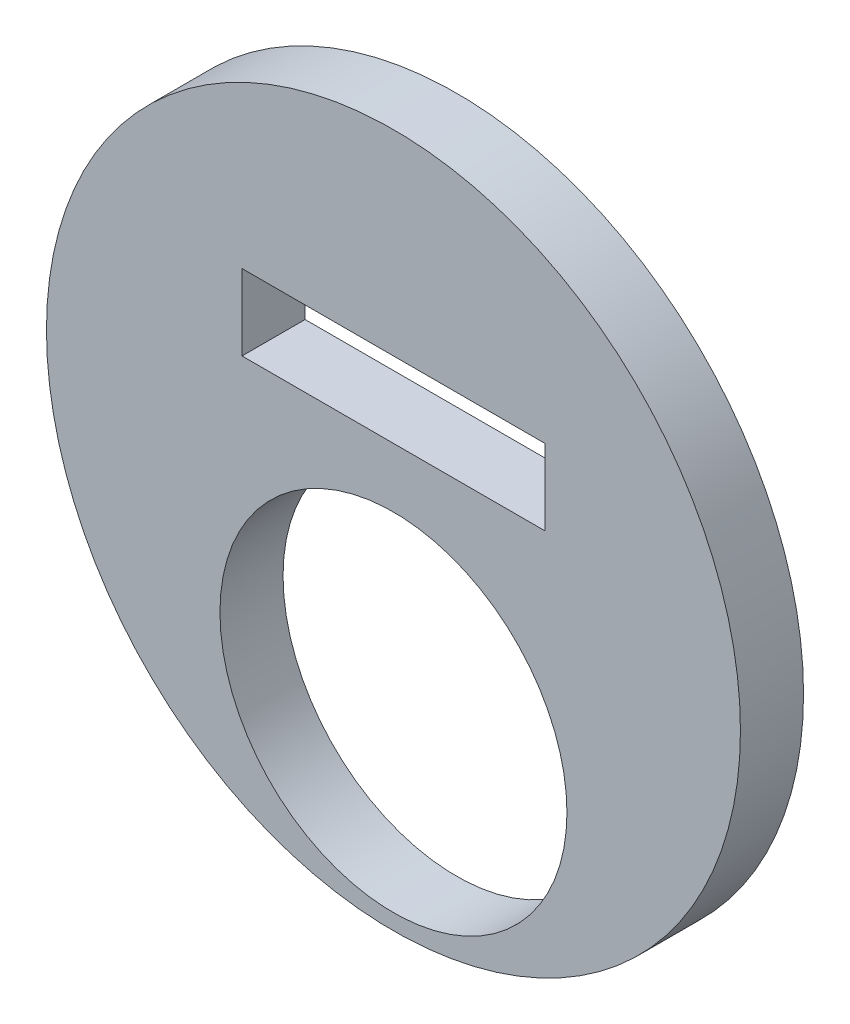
ISO-10303-21;
HEADER;
FILE_DESCRIPTION(('STEP AP214'),'2;1');
FILE_NAME('part.step','',(''),(''),'','','');
FILE_SCHEMA(('AUTOMOTIVE_DESIGN { 1 0 10303 214 1 1 1 1 }'));
ENDSEC;
DATA;
#1=APPLICATION_CONTEXT('core data for automotive mechanical design processes');
#2=APPLICATION_PROTOCOL_DEFINITION('international standard','automotive_design',2000,#1);
#3=PRODUCT_CONTEXT('',#1,'mechanical');
#4=PRODUCT('Part','Part','',(#3));
#5=PRODUCT_RELATED_PRODUCT_CATEGORY('part','',(#4));
#6=PRODUCT_DEFINITION_FORMATION('','',#4);
#7=PRODUCT_DEFINITION_CONTEXT('part definition',#1,'design');
#8=PRODUCT_DEFINITION('design','',#6,#7);
#9=PRODUCT_DEFINITION_SHAPE('','',#8);
#10=(LENGTH_UNIT() NAMED_UNIT(*) SI_UNIT(.MILLI.,.METRE.));
#11=(NAMED_UNIT(*) PLANE_ANGLE_UNIT() SI_UNIT($,.RADIAN.));
#12=(NAMED_UNIT(*) SI_UNIT($,.STERADIAN.) SOLID_ANGLE_UNIT());
#13=UNCERTAINTY_MEASURE_WITH_UNIT(LENGTH_MEASURE(1.E-05),#10,'distance_accuracy_value','');
#14=(GEOMETRIC_REPRESENTATION_CONTEXT(3) GLOBAL_UNCERTAINTY_ASSIGNED_CONTEXT((#13)) GLOBAL_UNIT_ASSIGNED_CONTEXT((#10,
#11,#12)) REPRESENTATION_CONTEXT('',''));
#15=CARTESIAN_POINT('',(0.,0.,0.));
#16=DIRECTION('',(0.,0.,1.));
#17=DIRECTION('',(1.,0.,0.));
#18=AXIS2_PLACEMENT_3D('',#15,#16,#17);
#19=CARTESIAN_POINT('',(0.,0.,3.175));
#20=DIRECTION('',(0.,0.,1.));
#21=DIRECTION('',(1.,0.,0.));
#22=AXIS2_PLACEMENT_3D('',#19,#20,#21);
#23=PLANE('',#22);
#24=CARTESIAN_POINT('',(0.,-7.9375,3.175));
#25=DIRECTION('',(0.,0.,1.));
#26=DIRECTION('',(1.,0.,0.));
#27=AXIS2_PLACEMENT_3D('',#24,#25,#26);
#28=CIRCLE('',#27,8.7312500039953);
#29=CARTESIAN_POINT('',(8.7312500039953,-7.9375,3.175));
#30=VERTEX_POINT('',#29);
#31=EDGE_CURVE('E95',#30,#30,#28,.T.);
#32=ORIENTED_EDGE('',*,*,#31,.F.);
#33=EDGE_LOOP('',(#32));
#34=FACE_BOUND('',#33,.T.);
#35=CARTESIAN_POINT('',(0.,0.,3.175));
#36=DIRECTION('',(0.,0.,1.));
#37=DIRECTION('',(1.,0.,0.));
#38=AXIS2_PLACEMENT_3D('',#35,#36,#37);
#39=CIRCLE('',#38,17.4625);
#40=CARTESIAN_POINT('',(17.4625,0.,3.175));
#41=VERTEX_POINT('',#40);
#42=EDGE_CURVE('E11',#41,#41,#39,.T.);
#43=ORIENTED_EDGE('',*,*,#42,.T.);
#44=EDGE_LOOP('',(#43));
#45=FACE_BOUND('',#44,.T.);
#46=DIRECTION('',(1.,0.,0.));
#47=VECTOR('',#46,1.);
#48=CARTESIAN_POINT('',(-7.62,3.7846,3.175));
#49=LINE('',#48,#47);
#50=CARTESIAN_POINT('',(-7.62,3.7846,3.175));
#51=VERTEX_POINT('',#50);
#52=CARTESIAN_POINT('',(7.62,3.7846,3.175));
#53=VERTEX_POINT('',#52);
#54=EDGE_CURVE('E102',#51,#53,#49,.T.);
#55=ORIENTED_EDGE('',*,*,#54,.F.);
#56=DIRECTION('',(0.,-1.,0.));
#57=VECTOR('',#56,1.);
#58=CARTESIAN_POINT('',(-7.62,7.5946,3.175));
#59=LINE('',#58,#57);
#60=CARTESIAN_POINT('',(-7.62,7.5946,3.175));
#61=VERTEX_POINT('',#60);
#62=EDGE_CURVE('E87',#61,#51,#59,.T.);
#63=ORIENTED_EDGE('',*,*,#62,.F.);
#64=DIRECTION('',(-1.,0.,0.));
#65=VECTOR('',#64,1.);
#66=CARTESIAN_POINT('',(-7.62,7.5946,3.175));
#67=LINE('',#66,#65);
#68=CARTESIAN_POINT('',(7.62,7.5946,3.175));
#69=VERTEX_POINT('',#68);
#70=EDGE_CURVE('E106',#69,#61,#67,.T.);
#71=ORIENTED_EDGE('',*,*,#70,.F.);
#72=DIRECTION('',(0.,1.,0.));
#73=VECTOR('',#72,1.);
#74=CARTESIAN_POINT('',(7.62,7.5946,3.175));
#75=LINE('',#74,#73);
#76=EDGE_CURVE('E104',#53,#69,#75,.T.);
#77=ORIENTED_EDGE('',*,*,#76,.F.);
#78=EDGE_LOOP('',(#55,#63,#71,#77));
#79=FACE_BOUND('',#78,.T.);
#80=ADVANCED_FACE('F31',(#34,#45,#79),#23,.T.);
#81=CARTESIAN_POINT('',(0.,0.,0.));
#82=DIRECTION('',(0.,0.,1.));
#83=DIRECTION('',(1.,0.,0.));
#84=AXIS2_PLACEMENT_3D('',#81,#82,#83);
#85=PLANE('',#84);
#86=CARTESIAN_POINT('',(0.,-7.9375,0.));
#87=DIRECTION('',(0.,0.,1.));
#88=DIRECTION('',(1.,0.,0.));
#89=AXIS2_PLACEMENT_3D('',#86,#87,#88);
#90=CIRCLE('',#89,8.7312500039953);
#91=CARTESIAN_POINT('',(8.7312500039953,-7.9375,0.));
#92=VERTEX_POINT('',#91);
#93=EDGE_CURVE('E92',#92,#92,#90,.T.);
#94=ORIENTED_EDGE('',*,*,#93,.T.);
#95=EDGE_LOOP('',(#94));
#96=FACE_BOUND('',#95,.T.);
#97=CARTESIAN_POINT('',(0.,0.,0.));
#98=DIRECTION('',(0.,0.,1.));
#99=DIRECTION('',(1.,0.,0.));
#100=AXIS2_PLACEMENT_3D('',#97,#98,#99);
#101=CIRCLE('',#100,17.4625);
#102=CARTESIAN_POINT('',(17.4625,0.,0.));
#103=VERTEX_POINT('',#102);
#104=EDGE_CURVE('E39',#103,#103,#101,.T.);
#105=ORIENTED_EDGE('',*,*,#104,.F.);
#106=EDGE_LOOP('',(#105));
#107=FACE_BOUND('',#106,.T.);
#108=DIRECTION('',(0.,-1.,0.));
#109=VECTOR('',#108,1.);
#110=CARTESIAN_POINT('',(-7.62,7.5946,0.));
#111=LINE('',#110,#109);
#112=CARTESIAN_POINT('',(-7.62,7.5946,0.));
#113=VERTEX_POINT('',#112);
#114=CARTESIAN_POINT('',(-7.62,3.7846,0.));
#115=VERTEX_POINT('',#114);
#116=EDGE_CURVE('E54',#113,#115,#111,.T.);
#117=ORIENTED_EDGE('',*,*,#116,.T.);
#118=DIRECTION('',(1.,0.,0.));
#119=VECTOR('',#118,1.);
#120=CARTESIAN_POINT('',(-7.62,3.7846,0.));
#121=LINE('',#120,#119);
#122=CARTESIAN_POINT('',(7.62,3.7846,0.));
#123=VERTEX_POINT('',#122);
#124=EDGE_CURVE('E74',#115,#123,#121,.T.);
#125=ORIENTED_EDGE('',*,*,#124,.T.);
#126=DIRECTION('',(0.,1.,0.));
#127=VECTOR('',#126,1.);
#128=CARTESIAN_POINT('',(7.62,7.5946,0.));
#129=LINE('',#128,#127);
#130=CARTESIAN_POINT('',(7.62,7.5946,0.));
#131=VERTEX_POINT('',#130);
#132=EDGE_CURVE('E83',#123,#131,#129,.T.);
#133=ORIENTED_EDGE('',*,*,#132,.T.);
#134=DIRECTION('',(-1.,0.,0.));
#135=VECTOR('',#134,1.);
#136=CARTESIAN_POINT('',(-7.62,7.5946,0.));
#137=LINE('',#136,#135);
#138=EDGE_CURVE('E91',#131,#113,#137,.T.);
#139=ORIENTED_EDGE('',*,*,#138,.T.);
#140=EDGE_LOOP('',(#117,#125,#133,#139));
#141=FACE_BOUND('',#140,.T.);
#142=ADVANCED_FACE('F90',(#96,#107,#141),#85,.F.);
#143=CARTESIAN_POINT('',(0.,0.,3.175));
#144=DIRECTION('',(0.,0.,-1.));
#145=DIRECTION('',(-1.,0.,0.));
#146=AXIS2_PLACEMENT_3D('',#143,#144,#145);
#147=CYLINDRICAL_SURFACE('',#146,17.4625);
#148=ORIENTED_EDGE('',*,*,#42,.F.);
#149=EDGE_LOOP('',(#148));
#150=FACE_BOUND('',#149,.T.);
#151=ORIENTED_EDGE('',*,*,#104,.T.);
#152=EDGE_LOOP('',(#151));
#153=FACE_BOUND('',#152,.T.);
#154=ADVANCED_FACE('F33',(#150,#153),#147,.T.);
#155=CARTESIAN_POINT('',(-7.62,7.5946,3.175));
#156=DIRECTION('',(1.,0.,0.));
#157=DIRECTION('',(0.,0.,-1.));
#158=AXIS2_PLACEMENT_3D('',#155,#156,#157);
#159=PLANE('',#158);
#160=ORIENTED_EDGE('',*,*,#116,.F.);
#161=DIRECTION('',(0.,0.,-1.));
#162=VECTOR('',#161,1.);
#163=CARTESIAN_POINT('',(-7.62,7.5946,3.175));
#164=LINE('',#163,#162);
#165=EDGE_CURVE('E108',#61,#113,#164,.T.);
#166=ORIENTED_EDGE('',*,*,#165,.F.);
#167=ORIENTED_EDGE('',*,*,#62,.T.);
#168=DIRECTION('',(0.,0.,-1.));
#169=VECTOR('',#168,1.);
#170=CARTESIAN_POINT('',(-7.62,3.7846,3.175));
#171=LINE('',#170,#169);
#172=EDGE_CURVE('E76',#51,#115,#171,.T.);
#173=ORIENTED_EDGE('',*,*,#172,.T.);
#174=EDGE_LOOP('',(#160,#166,#167,#173));
#175=FACE_BOUND('',#174,.T.);
#176=ADVANCED_FACE('F85',(#175),#159,.T.);
#177=CARTESIAN_POINT('',(-7.62,3.7846,3.175));
#178=DIRECTION('',(0.,1.,0.));
#179=DIRECTION('',(0.,0.,1.));
#180=AXIS2_PLACEMENT_3D('',#177,#178,#179);
#181=PLANE('',#180);
#182=ORIENTED_EDGE('',*,*,#124,.F.);
#183=ORIENTED_EDGE('',*,*,#172,.F.);
#184=ORIENTED_EDGE('',*,*,#54,.T.);
#185=DIRECTION('',(0.,0.,-1.));
#186=VECTOR('',#185,1.);
#187=CARTESIAN_POINT('',(7.62,3.7846,3.175));
#188=LINE('',#187,#186);
#189=EDGE_CURVE('E79',#53,#123,#188,.T.);
#190=ORIENTED_EDGE('',*,*,#189,.T.);
#191=EDGE_LOOP('',(#182,#183,#184,#190));
#192=FACE_BOUND('',#191,.T.);
#193=ADVANCED_FACE('F75',(#192),#181,.T.);
#194=CARTESIAN_POINT('',(7.62,7.5946,3.175));
#195=DIRECTION('',(-1.,0.,0.));
#196=DIRECTION('',(0.,-1.,0.));
#197=AXIS2_PLACEMENT_3D('',#194,#195,#196);
#198=PLANE('',#197);
#199=ORIENTED_EDGE('',*,*,#132,.F.);
#200=ORIENTED_EDGE('',*,*,#189,.F.);
#201=ORIENTED_EDGE('',*,*,#76,.T.);
#202=DIRECTION('',(0.,0.,-1.));
#203=VECTOR('',#202,1.);
#204=CARTESIAN_POINT('',(7.62,7.5946,3.175));
#205=LINE('',#204,#203);
#206=EDGE_CURVE('E46',#69,#131,#205,.T.);
#207=ORIENTED_EDGE('',*,*,#206,.T.);
#208=EDGE_LOOP('',(#199,#200,#201,#207));
#209=FACE_BOUND('',#208,.T.);
#210=ADVANCED_FACE('F129',(#209),#198,.T.);
#211=CARTESIAN_POINT('',(-7.62,7.5946,3.175));
#212=DIRECTION('',(0.,-1.,0.));
#213=DIRECTION('',(0.,0.,-1.));
#214=AXIS2_PLACEMENT_3D('',#211,#212,#213);
#215=PLANE('',#214);
#216=ORIENTED_EDGE('',*,*,#138,.F.);
#217=ORIENTED_EDGE('',*,*,#206,.F.);
#218=ORIENTED_EDGE('',*,*,#70,.T.);
#219=ORIENTED_EDGE('',*,*,#165,.T.);
#220=EDGE_LOOP('',(#216,#217,#218,#219));
#221=FACE_BOUND('',#220,.T.);
#222=ADVANCED_FACE('F132',(#221),#215,.T.);
#223=CARTESIAN_POINT('',(0.,-7.9375,0.));
#224=DIRECTION('',(0.,0.,1.));
#225=DIRECTION('',(1.,0.,0.));
#226=AXIS2_PLACEMENT_3D('',#223,#224,#225);
#227=CYLINDRICAL_SURFACE('',#226,8.7312500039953);
#228=ORIENTED_EDGE('',*,*,#93,.F.);
#229=EDGE_LOOP('',(#228));
#230=FACE_BOUND('',#229,.T.);
#231=ORIENTED_EDGE('',*,*,#31,.T.);
#232=EDGE_LOOP('',(#231));
#233=FACE_BOUND('',#232,.T.);
#234=ADVANCED_FACE('F136',(#230,#233),#227,.F.);
#235=CLOSED_SHELL('',(#80,#142,#154,#176,#193,#210,#222,#234));
#236=MANIFOLD_SOLID_BREP('B2',#235);
#237=ADVANCED_BREP_SHAPE_REPRESENTATION('',(#18,#236),#14);
#238=SHAPE_DEFINITION_REPRESENTATION(#9,#237);
ENDSEC;
END-ISO-10303-21;
